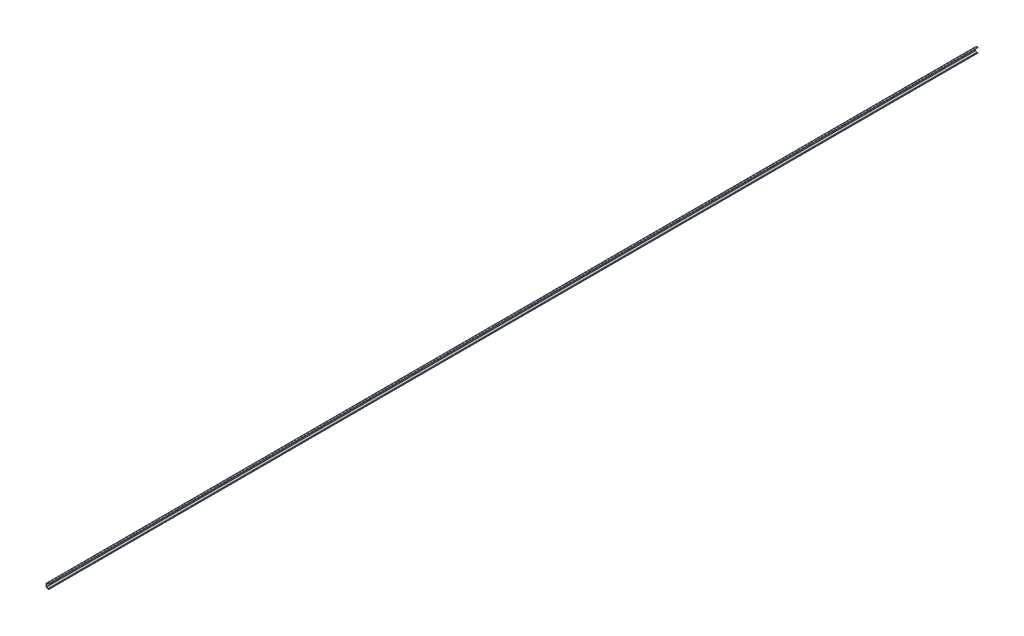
from build123d import *

# Parameters (mm, degrees)
EXTRUDE1_DEPTH  = 3120
EXTRUDE2_DEPTH  = 3121.025123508
LPATTERN1_COUNT = 39
LPATTERN1_PITCH = 80


with BuildPart() as part:
    # Sketch1 → Extrude1 (new body)
    with BuildSketch(Plane.XY):
        with BuildLine():
            Line((8.852847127, 6.521073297), (10, 8.159377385))
            Line((10, 8.159377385), (8.632108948, 9.117185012))
            ThreePointArc((8.632108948, 9.117185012), (7, 9.631786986), (5.367891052, 9.117185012))
            Line((5.367891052, 9.117185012), (1.382718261, 6.326736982))
            ThreePointArc((1.382718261, 6.326736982), (0.396073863, 5.224958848), (0, 3.8))
            Line((0, 3.8), (0, -3.8))
            ThreePointArc((0, -3.8), (0.368285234, -5.240165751), (1.382718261, -6.326736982))
            Line((1.382718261, -6.326736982), (5.367891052, -9.117185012))
            ThreePointArc((5.367891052, -9.117185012), (7, -9.631786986), (8.632108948, -9.117185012))
            Line((8.632108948, -9.117185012), (10, -8.159377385))
            Line((10, -8.159377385), (8.852847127, -6.521073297))
            Line((8.852847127, -6.521073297), (7.521966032, -7.452966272))
            ThreePointArc((7.521966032, -7.452966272), (7, -7.61754153), (6.478033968, -7.452966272))
            Line((6.478033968, -7.452966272), (2.369060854, -4.575832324))
            ThreePointArc((2.369060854, -4.575832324), (2.082184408, -4.236601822), (2, -3.8))
            Line((2, -3.8), (2, 3.8))
            ThreePointArc((2, 3.8), (2.096966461, 4.229570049), (2.369060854, 4.575832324))
            Line((2.369060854, 4.575832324), (6.478033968, 7.452966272))
            ThreePointArc((6.478033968, 7.452966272), (7, 7.61754153), (7.521966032, 7.452966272))
            Line((7.521966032, 7.452966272), (8.852847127, 6.521073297))
        make_face()
    extrude(amount=-EXTRUDE1_DEPTH)

    # Sketch2 → Extrude2 (cut, through all)
    with BuildSketch(Plane(origin=(2, 0, 0), x_dir=(0, 0, -1), z_dir=(1, 0, 0))):
        with BuildLine():
            Line((38.75, 2.25), (41.25, 2.25))
            ThreePointArc((41.25, 2.25), (43.5, 0), (41.25, -2.25))
            Line((41.25, -2.25), (38.75, -2.25))
            ThreePointArc((38.75, -2.25), (36.5, 0), (38.75, 2.25))
        make_face()
    extrude2 = extrude(amount=-EXTRUDE2_DEPTH, mode=Mode.SUBTRACT)

    # LPattern1: Extrude2 ×39
    with Locations(*[(0, 0, -i * LPATTERN1_PITCH) for i in range(1, LPATTERN1_COUNT)]):
        add(extrude2, mode=Mode.SUBTRACT)


solid = part.part
